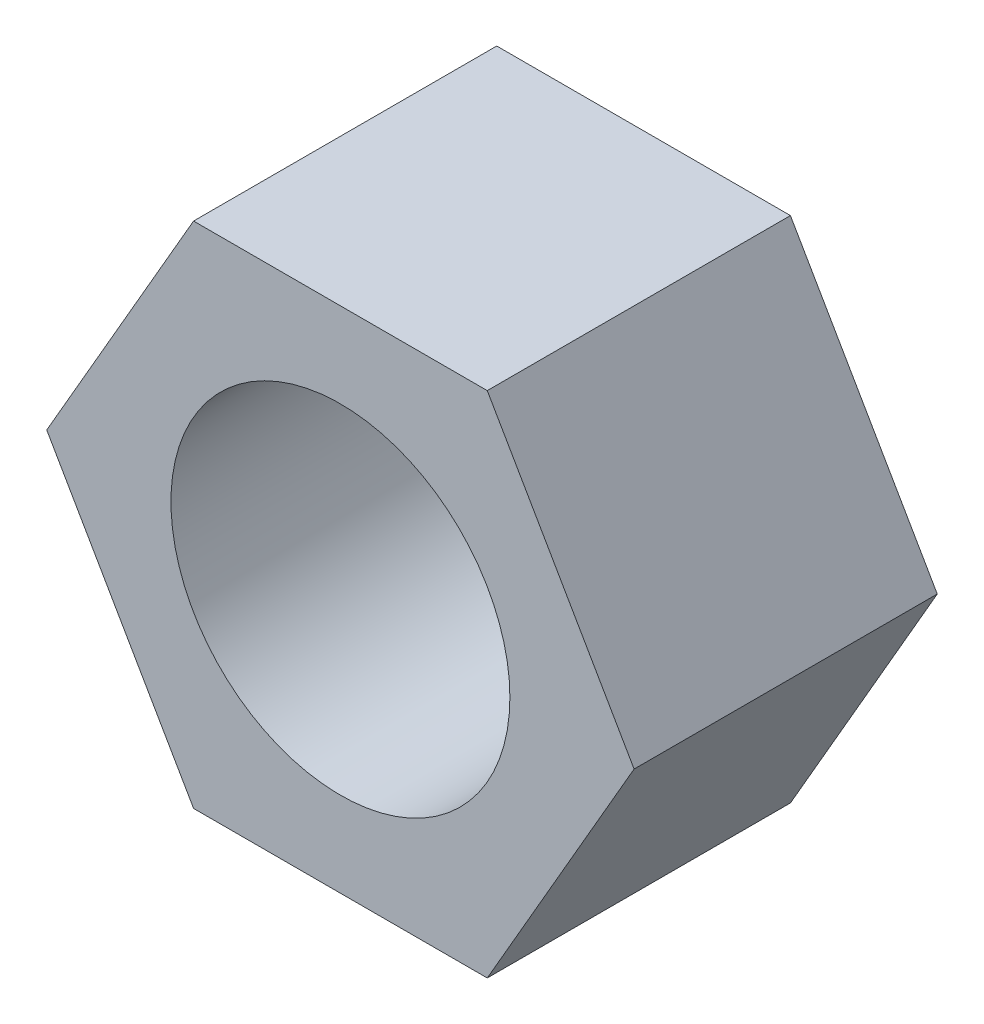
ISO-10303-21;
HEADER;
FILE_DESCRIPTION(('STEP AP214'),'2;1');
FILE_NAME('part.step','',(''),(''),'','','');
FILE_SCHEMA(('AUTOMOTIVE_DESIGN { 1 0 10303 214 1 1 1 1 }'));
ENDSEC;
DATA;
#1=APPLICATION_CONTEXT('core data for automotive mechanical design processes');
#2=APPLICATION_PROTOCOL_DEFINITION('international standard','automotive_design',2000,#1);
#3=PRODUCT_CONTEXT('',#1,'mechanical');
#4=PRODUCT('Part','Part','',(#3));
#5=PRODUCT_RELATED_PRODUCT_CATEGORY('part','',(#4));
#6=PRODUCT_DEFINITION_FORMATION('','',#4);
#7=PRODUCT_DEFINITION_CONTEXT('part definition',#1,'design');
#8=PRODUCT_DEFINITION('design','',#6,#7);
#9=PRODUCT_DEFINITION_SHAPE('','',#8);
#10=(LENGTH_UNIT() NAMED_UNIT(*) SI_UNIT(.MILLI.,.METRE.));
#11=(NAMED_UNIT(*) PLANE_ANGLE_UNIT() SI_UNIT($,.RADIAN.));
#12=(NAMED_UNIT(*) SI_UNIT($,.STERADIAN.) SOLID_ANGLE_UNIT());
#13=UNCERTAINTY_MEASURE_WITH_UNIT(LENGTH_MEASURE(1.E-05),#10,'distance_accuracy_value','');
#14=(GEOMETRIC_REPRESENTATION_CONTEXT(3) GLOBAL_UNCERTAINTY_ASSIGNED_CONTEXT((#13)) GLOBAL_UNIT_ASSIGNED_CONTEXT((#10,
#11,#12)) REPRESENTATION_CONTEXT('',''));
#15=CARTESIAN_POINT('',(0.,0.,0.));
#16=DIRECTION('',(0.,0.,1.));
#17=DIRECTION('',(1.,0.,0.));
#18=AXIS2_PLACEMENT_3D('',#15,#16,#17);
#19=CARTESIAN_POINT('',(6.87746570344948,-11.9126,14.1986));
#20=DIRECTION('',(-0.866060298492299,0.499939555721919,0.));
#21=DIRECTION('',(-0.499939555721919,-0.866060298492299,0.));
#22=AXIS2_PLACEMENT_3D('',#19,#20,#21);
#23=PLANE('',#22);
#24=DIRECTION('',(0.499939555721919,0.866060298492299,0.));
#25=VECTOR('',#24,1.);
#26=CARTESIAN_POINT('',(6.87746570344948,-11.9126,0.));
#27=LINE('',#26,#25);
#28=CARTESIAN_POINT('',(6.87746570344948,-11.9126,0.));
#29=VERTEX_POINT('',#28);
#30=CARTESIAN_POINT('',(13.7541,0.,0.));
#31=VERTEX_POINT('',#30);
#32=EDGE_CURVE('E84',#29,#31,#27,.T.);
#33=ORIENTED_EDGE('',*,*,#32,.T.);
#34=DIRECTION('',(0.,0.,-1.));
#35=VECTOR('',#34,1.);
#36=CARTESIAN_POINT('',(13.7541,0.,14.1986));
#37=LINE('',#36,#35);
#38=CARTESIAN_POINT('',(13.7541,0.,14.1986));
#39=VERTEX_POINT('',#38);
#40=EDGE_CURVE('E11',#39,#31,#37,.T.);
#41=ORIENTED_EDGE('',*,*,#40,.F.);
#42=DIRECTION('',(0.499939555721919,0.866060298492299,0.));
#43=VECTOR('',#42,1.);
#44=CARTESIAN_POINT('',(6.87746570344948,-11.9126,14.1986));
#45=LINE('',#44,#43);
#46=CARTESIAN_POINT('',(6.87746570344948,-11.9126,14.1986));
#47=VERTEX_POINT('',#46);
#48=EDGE_CURVE('E112',#47,#39,#45,.T.);
#49=ORIENTED_EDGE('',*,*,#48,.F.);
#50=DIRECTION('',(0.,0.,-1.));
#51=VECTOR('',#50,1.);
#52=CARTESIAN_POINT('',(6.87746570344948,-11.9126,14.1986));
#53=LINE('',#52,#51);
#54=EDGE_CURVE('E97',#47,#29,#53,.T.);
#55=ORIENTED_EDGE('',*,*,#54,.T.);
#56=EDGE_LOOP('',(#33,#41,#49,#55));
#57=FACE_BOUND('',#56,.T.);
#58=ADVANCED_FACE('F28',(#57),#23,.F.);
#59=CARTESIAN_POINT('',(6.87746570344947,11.9126,14.1986));
#60=DIRECTION('',(-0.866060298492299,-0.499939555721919,0.));
#61=DIRECTION('',(0.499939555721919,-0.866060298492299,0.));
#62=AXIS2_PLACEMENT_3D('',#59,#60,#61);
#63=PLANE('',#62);
#64=DIRECTION('',(-0.499939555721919,0.866060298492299,0.));
#65=VECTOR('',#64,1.);
#66=CARTESIAN_POINT('',(6.87746570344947,11.9126,0.));
#67=LINE('',#66,#65);
#68=CARTESIAN_POINT('',(6.87746570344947,11.9126,0.));
#69=VERTEX_POINT('',#68);
#70=EDGE_CURVE('E80',#31,#69,#67,.T.);
#71=ORIENTED_EDGE('',*,*,#70,.T.);
#72=DIRECTION('',(0.,0.,-1.));
#73=VECTOR('',#72,1.);
#74=CARTESIAN_POINT('',(6.87746570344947,11.9126,14.1986));
#75=LINE('',#74,#73);
#76=CARTESIAN_POINT('',(6.87746570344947,11.9126,14.1986));
#77=VERTEX_POINT('',#76);
#78=EDGE_CURVE('E35',#77,#69,#75,.T.);
#79=ORIENTED_EDGE('',*,*,#78,.F.);
#80=DIRECTION('',(-0.499939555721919,0.866060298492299,0.));
#81=VECTOR('',#80,1.);
#82=CARTESIAN_POINT('',(6.87746570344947,11.9126,14.1986));
#83=LINE('',#82,#81);
#84=EDGE_CURVE('E93',#39,#77,#83,.T.);
#85=ORIENTED_EDGE('',*,*,#84,.F.);
#86=ORIENTED_EDGE('',*,*,#40,.T.);
#87=EDGE_LOOP('',(#71,#79,#85,#86));
#88=FACE_BOUND('',#87,.T.);
#89=ADVANCED_FACE('F92',(#88),#63,.F.);
#90=CARTESIAN_POINT('',(6.87746570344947,11.9126,14.1986));
#91=DIRECTION('',(0.,-1.,0.));
#92=DIRECTION('',(0.,0.,-1.));
#93=AXIS2_PLACEMENT_3D('',#90,#91,#92);
#94=PLANE('',#93);
#95=DIRECTION('',(-1.,0.,0.));
#96=VECTOR('',#95,1.);
#97=CARTESIAN_POINT('',(6.87746570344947,11.9126,0.));
#98=LINE('',#97,#96);
#99=CARTESIAN_POINT('',(-6.87746570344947,11.9126,0.));
#100=VERTEX_POINT('',#99);
#101=EDGE_CURVE('E86',#69,#100,#98,.T.);
#102=ORIENTED_EDGE('',*,*,#101,.T.);
#103=DIRECTION('',(0.,0.,-1.));
#104=VECTOR('',#103,1.);
#105=CARTESIAN_POINT('',(-6.87746570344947,11.9126,14.1986));
#106=LINE('',#105,#104);
#107=CARTESIAN_POINT('',(-6.87746570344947,11.9126,14.1986));
#108=VERTEX_POINT('',#107);
#109=EDGE_CURVE('E128',#108,#100,#106,.T.);
#110=ORIENTED_EDGE('',*,*,#109,.F.);
#111=DIRECTION('',(-1.,0.,0.));
#112=VECTOR('',#111,1.);
#113=CARTESIAN_POINT('',(6.87746570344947,11.9126,14.1986));
#114=LINE('',#113,#112);
#115=EDGE_CURVE('E115',#77,#108,#114,.T.);
#116=ORIENTED_EDGE('',*,*,#115,.F.);
#117=ORIENTED_EDGE('',*,*,#78,.T.);
#118=EDGE_LOOP('',(#102,#110,#116,#117));
#119=FACE_BOUND('',#118,.T.);
#120=ADVANCED_FACE('F132',(#119),#94,.F.);
#121=CARTESIAN_POINT('',(-6.87746570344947,11.9126,14.1986));
#122=DIRECTION('',(0.866060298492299,-0.499939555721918,0.));
#123=DIRECTION('',(0.499939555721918,0.866060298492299,0.));
#124=AXIS2_PLACEMENT_3D('',#121,#122,#123);
#125=PLANE('',#124);
#126=DIRECTION('',(-0.499939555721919,-0.866060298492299,0.));
#127=VECTOR('',#126,1.);
#128=CARTESIAN_POINT('',(-6.87746570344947,11.9126,0.));
#129=LINE('',#128,#127);
#130=CARTESIAN_POINT('',(-13.7541,0.,0.));
#131=VERTEX_POINT('',#130);
#132=EDGE_CURVE('E106',#100,#131,#129,.T.);
#133=ORIENTED_EDGE('',*,*,#132,.T.);
#134=DIRECTION('',(0.,0.,-1.));
#135=VECTOR('',#134,1.);
#136=CARTESIAN_POINT('',(-13.7541,0.,14.1986));
#137=LINE('',#136,#135);
#138=CARTESIAN_POINT('',(-13.7541,0.,14.1986));
#139=VERTEX_POINT('',#138);
#140=EDGE_CURVE('E125',#139,#131,#137,.T.);
#141=ORIENTED_EDGE('',*,*,#140,.F.);
#142=DIRECTION('',(-0.499939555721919,-0.866060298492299,0.));
#143=VECTOR('',#142,1.);
#144=CARTESIAN_POINT('',(-6.87746570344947,11.9126,14.1986));
#145=LINE('',#144,#143);
#146=EDGE_CURVE('E117',#108,#139,#145,.T.);
#147=ORIENTED_EDGE('',*,*,#146,.F.);
#148=ORIENTED_EDGE('',*,*,#109,.T.);
#149=EDGE_LOOP('',(#133,#141,#147,#148));
#150=FACE_BOUND('',#149,.T.);
#151=ADVANCED_FACE('F138',(#150),#125,.F.);
#152=CARTESIAN_POINT('',(-6.87746570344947,-11.9126,14.1986));
#153=DIRECTION('',(0.866060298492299,0.499939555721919,0.));
#154=DIRECTION('',(-0.499939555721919,0.866060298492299,0.));
#155=AXIS2_PLACEMENT_3D('',#152,#153,#154);
#156=PLANE('',#155);
#157=DIRECTION('',(0.499939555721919,-0.866060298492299,0.));
#158=VECTOR('',#157,1.);
#159=CARTESIAN_POINT('',(-6.87746570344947,-11.9126,0.));
#160=LINE('',#159,#158);
#161=CARTESIAN_POINT('',(-6.87746570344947,-11.9126,0.));
#162=VERTEX_POINT('',#161);
#163=EDGE_CURVE('E108',#131,#162,#160,.T.);
#164=ORIENTED_EDGE('',*,*,#163,.T.);
#165=DIRECTION('',(0.,0.,-1.));
#166=VECTOR('',#165,1.);
#167=CARTESIAN_POINT('',(-6.87746570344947,-11.9126,14.1986));
#168=LINE('',#167,#166);
#169=CARTESIAN_POINT('',(-6.87746570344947,-11.9126,14.1986));
#170=VERTEX_POINT('',#169);
#171=EDGE_CURVE('E122',#170,#162,#168,.T.);
#172=ORIENTED_EDGE('',*,*,#171,.F.);
#173=DIRECTION('',(0.499939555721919,-0.866060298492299,0.));
#174=VECTOR('',#173,1.);
#175=CARTESIAN_POINT('',(-6.87746570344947,-11.9126,14.1986));
#176=LINE('',#175,#174);
#177=EDGE_CURVE('E47',#139,#170,#176,.T.);
#178=ORIENTED_EDGE('',*,*,#177,.F.);
#179=ORIENTED_EDGE('',*,*,#140,.T.);
#180=EDGE_LOOP('',(#164,#172,#178,#179));
#181=FACE_BOUND('',#180,.T.);
#182=ADVANCED_FACE('F141',(#181),#156,.F.);
#183=CARTESIAN_POINT('',(6.87746570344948,-11.9126,14.1986));
#184=DIRECTION('',(0.,1.,0.));
#185=DIRECTION('',(-1.,0.,0.));
#186=AXIS2_PLACEMENT_3D('',#183,#184,#185);
#187=PLANE('',#186);
#188=DIRECTION('',(1.,0.,0.));
#189=VECTOR('',#188,1.);
#190=CARTESIAN_POINT('',(6.87746570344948,-11.9126,0.));
#191=LINE('',#190,#189);
#192=EDGE_CURVE('E110',#162,#29,#191,.T.);
#193=ORIENTED_EDGE('',*,*,#192,.T.);
#194=ORIENTED_EDGE('',*,*,#54,.F.);
#195=DIRECTION('',(1.,0.,0.));
#196=VECTOR('',#195,1.);
#197=CARTESIAN_POINT('',(6.87746570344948,-11.9126,14.1986));
#198=LINE('',#197,#196);
#199=EDGE_CURVE('E42',#170,#47,#198,.T.);
#200=ORIENTED_EDGE('',*,*,#199,.F.);
#201=ORIENTED_EDGE('',*,*,#171,.T.);
#202=EDGE_LOOP('',(#193,#194,#200,#201));
#203=FACE_BOUND('',#202,.T.);
#204=ADVANCED_FACE('F143',(#203),#187,.F.);
#205=CARTESIAN_POINT('',(20.6307342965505,11.9126,14.1986));
#206=DIRECTION('',(0.,0.,1.));
#207=DIRECTION('',(1.,0.,0.));
#208=AXIS2_PLACEMENT_3D('',#205,#206,#207);
#209=PLANE('',#208);
#210=CARTESIAN_POINT('',(0.,0.,14.1986));
#211=DIRECTION('',(0.,0.,1.));
#212=DIRECTION('',(1.,0.,0.));
#213=AXIS2_PLACEMENT_3D('',#210,#211,#212);
#214=CIRCLE('',#213,7.9375);
#215=CARTESIAN_POINT('',(7.9375,0.,14.1986));
#216=VERTEX_POINT('',#215);
#217=EDGE_CURVE('E101',#216,#216,#214,.T.);
#218=ORIENTED_EDGE('',*,*,#217,.F.);
#219=EDGE_LOOP('',(#218));
#220=FACE_BOUND('',#219,.T.);
#221=ORIENTED_EDGE('',*,*,#48,.T.);
#222=ORIENTED_EDGE('',*,*,#84,.T.);
#223=ORIENTED_EDGE('',*,*,#115,.T.);
#224=ORIENTED_EDGE('',*,*,#146,.T.);
#225=ORIENTED_EDGE('',*,*,#177,.T.);
#226=ORIENTED_EDGE('',*,*,#199,.T.);
#227=EDGE_LOOP('',(#221,#222,#223,#224,#225,#226));
#228=FACE_BOUND('',#227,.T.);
#229=ADVANCED_FACE('F135',(#220,#228),#209,.T.);
#230=CARTESIAN_POINT('',(20.6307342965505,11.9126,0.));
#231=DIRECTION('',(0.,0.,1.));
#232=DIRECTION('',(1.,0.,0.));
#233=AXIS2_PLACEMENT_3D('',#230,#231,#232);
#234=PLANE('',#233);
#235=CARTESIAN_POINT('',(0.,0.,0.));
#236=DIRECTION('',(0.,0.,1.));
#237=DIRECTION('',(1.,0.,0.));
#238=AXIS2_PLACEMENT_3D('',#235,#236,#237);
#239=CIRCLE('',#238,7.9375);
#240=CARTESIAN_POINT('',(7.9375,0.,0.));
#241=VERTEX_POINT('',#240);
#242=EDGE_CURVE('E98',#241,#241,#239,.T.);
#243=ORIENTED_EDGE('',*,*,#242,.T.);
#244=EDGE_LOOP('',(#243));
#245=FACE_BOUND('',#244,.T.);
#246=ORIENTED_EDGE('',*,*,#32,.F.);
#247=ORIENTED_EDGE('',*,*,#192,.F.);
#248=ORIENTED_EDGE('',*,*,#163,.F.);
#249=ORIENTED_EDGE('',*,*,#132,.F.);
#250=ORIENTED_EDGE('',*,*,#101,.F.);
#251=ORIENTED_EDGE('',*,*,#70,.F.);
#252=EDGE_LOOP('',(#246,#247,#248,#249,#250,#251));
#253=FACE_BOUND('',#252,.T.);
#254=ADVANCED_FACE('F81',(#245,#253),#234,.F.);
#255=CARTESIAN_POINT('',(0.,0.,0.));
#256=DIRECTION('',(0.,0.,1.));
#257=DIRECTION('',(1.,0.,0.));
#258=AXIS2_PLACEMENT_3D('',#255,#256,#257);
#259=CYLINDRICAL_SURFACE('',#258,7.9375);
#260=CARTESIAN_POINT('',(7.9375,0.,0.));
#261=CARTESIAN_POINT('',(7.9375,0.,0.147902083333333));
#262=CARTESIAN_POINT('',(7.9375,0.,0.295804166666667));
#263=CARTESIAN_POINT('',(7.9375,0.,0.591608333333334));
#264=CARTESIAN_POINT('',(7.9375,0.,0.739510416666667));
#265=CARTESIAN_POINT('',(7.9375,0.,1.03531458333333));
#266=CARTESIAN_POINT('',(7.9375,0.,1.18321666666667));
#267=CARTESIAN_POINT('',(7.9375,0.,1.47902083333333));
#268=CARTESIAN_POINT('',(7.9375,0.,1.62692291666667));
#269=CARTESIAN_POINT('',(7.9375,0.,1.92272708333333));
#270=CARTESIAN_POINT('',(7.9375,0.,2.07062916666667));
#271=CARTESIAN_POINT('',(7.9375,0.,2.36643333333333));
#272=CARTESIAN_POINT('',(7.9375,0.,2.51433541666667));
#273=CARTESIAN_POINT('',(7.9375,0.,2.81013958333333));
#274=CARTESIAN_POINT('',(7.9375,0.,2.95804166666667));
#275=CARTESIAN_POINT('',(7.9375,0.,3.25384583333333));
#276=CARTESIAN_POINT('',(7.9375,0.,3.40174791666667));
#277=CARTESIAN_POINT('',(7.9375,0.,3.69755208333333));
#278=CARTESIAN_POINT('',(7.9375,0.,3.84545416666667));
#279=CARTESIAN_POINT('',(7.9375,0.,4.14125833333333));
#280=CARTESIAN_POINT('',(7.9375,0.,4.28916041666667));
#281=CARTESIAN_POINT('',(7.9375,0.,4.58496458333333));
#282=CARTESIAN_POINT('',(7.9375,0.,4.73286666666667));
#283=CARTESIAN_POINT('',(7.9375,0.,5.02867083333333));
#284=CARTESIAN_POINT('',(7.9375,0.,5.17657291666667));
#285=CARTESIAN_POINT('',(7.9375,0.,5.47237708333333));
#286=CARTESIAN_POINT('',(7.9375,0.,5.62027916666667));
#287=CARTESIAN_POINT('',(7.9375,0.,5.91608333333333));
#288=CARTESIAN_POINT('',(7.9375,0.,6.06398541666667));
#289=CARTESIAN_POINT('',(7.9375,0.,6.35978958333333));
#290=CARTESIAN_POINT('',(7.9375,0.,6.50769166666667));
#291=CARTESIAN_POINT('',(7.9375,0.,6.80349583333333));
#292=CARTESIAN_POINT('',(7.9375,0.,6.95139791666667));
#293=CARTESIAN_POINT('',(7.9375,0.,7.24720208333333));
#294=CARTESIAN_POINT('',(7.9375,0.,7.39510416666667));
#295=CARTESIAN_POINT('',(7.9375,0.,7.69090833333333));
#296=CARTESIAN_POINT('',(7.9375,0.,7.83881041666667));
#297=CARTESIAN_POINT('',(7.9375,0.,8.13461458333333));
#298=CARTESIAN_POINT('',(7.9375,0.,8.28251666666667));
#299=CARTESIAN_POINT('',(7.9375,0.,8.57832083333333));
#300=CARTESIAN_POINT('',(7.9375,0.,8.72622291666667));
#301=CARTESIAN_POINT('',(7.9375,0.,9.02202708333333));
#302=CARTESIAN_POINT('',(7.9375,0.,9.16992916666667));
#303=CARTESIAN_POINT('',(7.9375,0.,9.46573333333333));
#304=CARTESIAN_POINT('',(7.9375,0.,9.61363541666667));
#305=CARTESIAN_POINT('',(7.9375,0.,9.90943958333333));
#306=CARTESIAN_POINT('',(7.9375,0.,10.0573416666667));
#307=CARTESIAN_POINT('',(7.9375,0.,10.3531458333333));
#308=CARTESIAN_POINT('',(7.9375,0.,10.5010479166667));
#309=CARTESIAN_POINT('',(7.9375,0.,10.7968520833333));
#310=CARTESIAN_POINT('',(7.9375,0.,10.9447541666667));
#311=CARTESIAN_POINT('',(7.9375,0.,11.2405583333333));
#312=CARTESIAN_POINT('',(7.9375,0.,11.3884604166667));
#313=CARTESIAN_POINT('',(7.9375,0.,11.6842645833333));
#314=CARTESIAN_POINT('',(7.9375,0.,11.8321666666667));
#315=CARTESIAN_POINT('',(7.9375,0.,12.1279708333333));
#316=CARTESIAN_POINT('',(7.9375,0.,12.2758729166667));
#317=CARTESIAN_POINT('',(7.9375,0.,12.5716770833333));
#318=CARTESIAN_POINT('',(7.9375,0.,12.7195791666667));
#319=CARTESIAN_POINT('',(7.9375,0.,13.0153833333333));
#320=CARTESIAN_POINT('',(7.9375,0.,13.1632854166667));
#321=CARTESIAN_POINT('',(7.9375,0.,13.4590895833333));
#322=CARTESIAN_POINT('',(7.9375,0.,13.6069916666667));
#323=CARTESIAN_POINT('',(7.9375,0.,13.9027958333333));
#324=CARTESIAN_POINT('',(7.9375,0.,14.0506979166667));
#325=CARTESIAN_POINT('',(7.9375,0.,14.1986));
#326=B_SPLINE_CURVE_WITH_KNOTS('',3,(#260,#261,#262,#263,#264,#265,#266,#267,#268,#269,#270,
#271,#272,#273,#274,#275,#276,#277,#278,#279,#280,#281,#282,#283,#284,#285,#286,#287,#288,#289,
#290,#291,#292,#293,#294,#295,#296,#297,#298,#299,#300,#301,#302,#303,#304,#305,#306,#307,#308,
#309,#310,#311,#312,#313,#314,#315,#316,#317,#318,#319,#320,#321,#322,#323,#324,#325),
.UNSPECIFIED.,.F.,.F.,(4,2,2,2,2,2,2,2,2,2,2,2,2,2,2,2,2,2,2,2,2,2,2,2,2,2,2,2,2,2,2,2,4),(0.,
0.44370625,0.8874125,1.33111875,1.774825,2.21853125,2.6622375,3.10594375,3.54965,3.99335625,
4.4370625,4.88076875,5.324475,5.76818125,6.2118875,6.65559375,7.0993,7.54300625,7.9867125,
8.43041875,8.874125,9.31783125,9.7615375,10.20524375,10.64895,11.09265625,11.5363625,
11.98006875,12.423775,12.86748125,13.3111875,13.75489375,14.1986),.UNSPECIFIED.);
#327=EDGE_CURVE('BSEAM184',#241,#216,#326,.T.);
#328=ORIENTED_EDGE('',*,*,#242,.F.);
#329=ORIENTED_EDGE('',*,*,#217,.T.);
#330=ORIENTED_EDGE('',*,*,#327,.T.);
#331=ORIENTED_EDGE('',*,*,#327,.F.);
#332=EDGE_LOOP('',(#328,#330,#329,#331));
#333=FACE_BOUND('',#332,.T.);
#334=ADVANCED_FACE('F184',(#333),#259,.F.);
#335=CLOSED_SHELL('',(#58,#89,#120,#151,#182,#204,#229,#254,#334));
#336=MANIFOLD_SOLID_BREP('B2',#335);
#337=ADVANCED_BREP_SHAPE_REPRESENTATION('',(#18,#336),#14);
#338=SHAPE_DEFINITION_REPRESENTATION(#9,#337);
ENDSEC;
END-ISO-10303-21;
